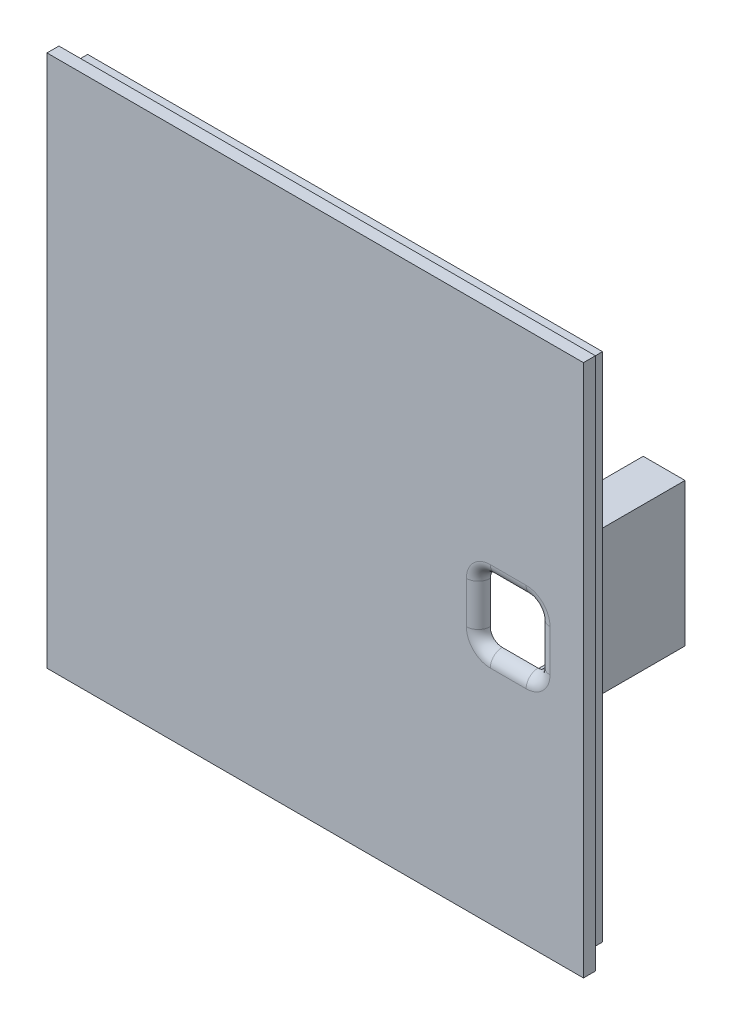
ISO-10303-21;
HEADER;
FILE_DESCRIPTION(('STEP AP214'),'2;1');
FILE_NAME('part.step','',(''),(''),'','','');
FILE_SCHEMA(('AUTOMOTIVE_DESIGN { 1 0 10303 214 1 1 1 1 }'));
ENDSEC;
DATA;
#1=APPLICATION_CONTEXT('core data for automotive mechanical design processes');
#2=APPLICATION_PROTOCOL_DEFINITION('international standard','automotive_design',2000,#1);
#3=PRODUCT_CONTEXT('',#1,'mechanical');
#4=PRODUCT('Part','Part','',(#3));
#5=PRODUCT_RELATED_PRODUCT_CATEGORY('part','',(#4));
#6=PRODUCT_DEFINITION_FORMATION('','',#4);
#7=PRODUCT_DEFINITION_CONTEXT('part definition',#1,'design');
#8=PRODUCT_DEFINITION('design','',#6,#7);
#9=PRODUCT_DEFINITION_SHAPE('','',#8);
#10=(LENGTH_UNIT() NAMED_UNIT(*) SI_UNIT(.MILLI.,.METRE.));
#11=(NAMED_UNIT(*) PLANE_ANGLE_UNIT() SI_UNIT($,.RADIAN.));
#12=(NAMED_UNIT(*) SI_UNIT($,.STERADIAN.) SOLID_ANGLE_UNIT());
#13=UNCERTAINTY_MEASURE_WITH_UNIT(LENGTH_MEASURE(1.E-05),#10,'distance_accuracy_value','');
#14=(GEOMETRIC_REPRESENTATION_CONTEXT(3) GLOBAL_UNCERTAINTY_ASSIGNED_CONTEXT((#13)) GLOBAL_UNIT_ASSIGNED_CONTEXT((#10,
#11,#12)) REPRESENTATION_CONTEXT('',''));
#15=CARTESIAN_POINT('',(0.,0.,0.));
#16=DIRECTION('',(0.,0.,1.));
#17=DIRECTION('',(1.,0.,0.));
#18=AXIS2_PLACEMENT_3D('',#15,#16,#17);
#19=CARTESIAN_POINT('',(0.,0.,0.));
#20=DIRECTION('',(0.,0.,1.));
#21=DIRECTION('',(1.,0.,0.));
#22=AXIS2_PLACEMENT_3D('',#19,#20,#21);
#23=PLANE('',#22);
#24=DIRECTION('',(0.,-1.,0.));
#25=VECTOR('',#24,1.);
#26=CARTESIAN_POINT('',(-47.6774369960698,36.0817086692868,0.));
#27=LINE('',#26,#25);
#28=CARTESIAN_POINT('',(-47.6774369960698,36.0817086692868,0.));
#29=VERTEX_POINT('',#28);
#30=CARTESIAN_POINT('',(-47.6774369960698,-45.1182913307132,0.));
#31=VERTEX_POINT('',#30);
#32=EDGE_CURVE('E605',#29,#31,#27,.T.);
#33=ORIENTED_EDGE('',*,*,#32,.F.);
#34=DIRECTION('',(-1.,0.,0.));
#35=VECTOR('',#34,1.);
#36=CARTESIAN_POINT('',(-47.6774369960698,36.0817086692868,0.));
#37=LINE('',#36,#35);
#38=CARTESIAN_POINT('',(34.1225630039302,36.0817086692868,0.));
#39=VERTEX_POINT('',#38);
#40=EDGE_CURVE('E653',#39,#29,#37,.T.);
#41=ORIENTED_EDGE('',*,*,#40,.F.);
#42=DIRECTION('',(0.,1.,0.));
#43=VECTOR('',#42,1.);
#44=CARTESIAN_POINT('',(34.1225630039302,36.0817086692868,0.));
#45=LINE('',#44,#43);
#46=CARTESIAN_POINT('',(34.1225630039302,-45.1182913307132,0.));
#47=VERTEX_POINT('',#46);
#48=EDGE_CURVE('E650',#47,#39,#45,.T.);
#49=ORIENTED_EDGE('',*,*,#48,.F.);
#50=DIRECTION('',(1.,0.,0.));
#51=VECTOR('',#50,1.);
#52=CARTESIAN_POINT('',(-47.6774369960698,-45.1182913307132,0.));
#53=LINE('',#52,#51);
#54=EDGE_CURVE('E647',#31,#47,#53,.T.);
#55=ORIENTED_EDGE('',*,*,#54,.F.);
#56=EDGE_LOOP('',(#33,#41,#49,#55));
#57=FACE_BOUND('',#56,.T.);
#58=CARTESIAN_POINT('',(28.5225630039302,-0.990921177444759,0.));
#59=DIRECTION('',(0.,0.,-1.));
#60=DIRECTION('',(1.,0.,0.));
#61=AXIS2_PLACEMENT_3D('',#58,#59,#60);
#62=CIRCLE('',#61,2.);
#63=CARTESIAN_POINT('',(28.5225630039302,1.00907882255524,0.));
#64=VERTEX_POINT('',#63);
#65=CARTESIAN_POINT('',(29.1225630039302,0.916957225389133,0.));
#66=VERTEX_POINT('',#65);
#67=EDGE_CURVE('E265',#64,#66,#62,.T.);
#68=ORIENTED_EDGE('',*,*,#67,.F.);
#69=DIRECTION('',(1.,0.,0.));
#70=VECTOR('',#69,1.);
#71=CARTESIAN_POINT('',(28.5225630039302,1.00907882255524,0.));
#72=LINE('',#71,#70);
#73=CARTESIAN_POINT('',(22.5225630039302,1.00907882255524,0.));
#74=VERTEX_POINT('',#73);
#75=EDGE_CURVE('E504',#74,#64,#72,.T.);
#76=ORIENTED_EDGE('',*,*,#75,.F.);
#77=CARTESIAN_POINT('',(22.5225630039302,-0.990921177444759,0.));
#78=DIRECTION('',(0.,0.,-1.));
#79=DIRECTION('',(1.,0.,0.));
#80=AXIS2_PLACEMENT_3D('',#77,#78,#79);
#81=CIRCLE('',#80,2.);
#82=CARTESIAN_POINT('',(20.5225630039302,-0.990921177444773,0.));
#83=VERTEX_POINT('',#82);
#84=EDGE_CURVE('E499',#83,#74,#81,.T.);
#85=ORIENTED_EDGE('',*,*,#84,.F.);
#86=DIRECTION('',(0.,1.,0.));
#87=VECTOR('',#86,1.);
#88=CARTESIAN_POINT('',(20.5225630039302,-7.99092117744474,0.));
#89=LINE('',#88,#87);
#90=CARTESIAN_POINT('',(20.5225630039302,-7.99092117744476,0.));
#91=VERTEX_POINT('',#90);
#92=EDGE_CURVE('E497',#91,#83,#89,.T.);
#93=ORIENTED_EDGE('',*,*,#92,.F.);
#94=CARTESIAN_POINT('',(22.5225630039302,-7.99092117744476,0.));
#95=DIRECTION('',(0.,0.,-1.));
#96=DIRECTION('',(-1.,0.,0.));
#97=AXIS2_PLACEMENT_3D('',#94,#95,#96);
#98=CIRCLE('',#97,2.);
#99=CARTESIAN_POINT('',(22.5225630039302,-9.99092117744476,0.));
#100=VERTEX_POINT('',#99);
#101=EDGE_CURVE('E500',#100,#91,#98,.T.);
#102=ORIENTED_EDGE('',*,*,#101,.F.);
#103=DIRECTION('',(-1.,0.,0.));
#104=VECTOR('',#103,1.);
#105=CARTESIAN_POINT('',(28.5225630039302,-9.99092117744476,0.));
#106=LINE('',#105,#104);
#107=CARTESIAN_POINT('',(28.5225630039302,-9.99092117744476,0.));
#108=VERTEX_POINT('',#107);
#109=EDGE_CURVE('E486',#108,#100,#106,.T.);
#110=ORIENTED_EDGE('',*,*,#109,.F.);
#111=CARTESIAN_POINT('',(28.5225630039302,-7.99092117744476,0.));
#112=DIRECTION('',(0.,0.,-1.));
#113=DIRECTION('',(-1.,0.,0.));
#114=AXIS2_PLACEMENT_3D('',#111,#112,#113);
#115=CIRCLE('',#114,2.);
#116=CARTESIAN_POINT('',(29.1225630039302,-9.89879958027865,0.));
#117=VERTEX_POINT('',#116);
#118=EDGE_CURVE('E264',#117,#108,#115,.T.);
#119=ORIENTED_EDGE('',*,*,#118,.F.);
#120=DIRECTION('',(0.,-1.,0.));
#121=VECTOR('',#120,1.);
#122=CARTESIAN_POINT('',(29.1225630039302,0.,0.));
#123=LINE('',#122,#121);
#124=CARTESIAN_POINT('',(29.1225630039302,-14.4909211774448,0.));
#125=VERTEX_POINT('',#124);
#126=EDGE_CURVE('E552',#117,#125,#123,.T.);
#127=ORIENTED_EDGE('',*,*,#126,.T.);
#128=DIRECTION('',(1.,0.,0.));
#129=VECTOR('',#128,1.);
#130=CARTESIAN_POINT('',(0.,-14.4909211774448,0.));
#131=LINE('',#130,#129);
#132=CARTESIAN_POINT('',(24.1225630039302,-14.4909211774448,0.));
#133=VERTEX_POINT('',#132);
#134=EDGE_CURVE('E548',#133,#125,#131,.T.);
#135=ORIENTED_EDGE('',*,*,#134,.F.);
#136=DIRECTION('',(0.,-1.,0.));
#137=VECTOR('',#136,1.);
#138=CARTESIAN_POINT('',(24.1225630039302,0.,0.));
#139=LINE('',#138,#137);
#140=CARTESIAN_POINT('',(24.1225630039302,-16.4909211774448,0.));
#141=VERTEX_POINT('',#140);
#142=EDGE_CURVE('E528',#133,#141,#139,.T.);
#143=ORIENTED_EDGE('',*,*,#142,.T.);
#144=DIRECTION('',(1.,0.,0.));
#145=VECTOR('',#144,1.);
#146=CARTESIAN_POINT('',(0.,-16.4909211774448,0.));
#147=LINE('',#146,#145);
#148=CARTESIAN_POINT('',(31.1225630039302,-16.4909211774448,0.));
#149=VERTEX_POINT('',#148);
#150=EDGE_CURVE('E536',#141,#149,#147,.T.);
#151=ORIENTED_EDGE('',*,*,#150,.T.);
#152=DIRECTION('',(0.,-1.,0.));
#153=VECTOR('',#152,1.);
#154=CARTESIAN_POINT('',(31.1225630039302,0.,0.));
#155=LINE('',#154,#153);
#156=CARTESIAN_POINT('',(31.1225630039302,7.50907882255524,0.));
#157=VERTEX_POINT('',#156);
#158=EDGE_CURVE('E567',#157,#149,#155,.T.);
#159=ORIENTED_EDGE('',*,*,#158,.F.);
#160=DIRECTION('',(1.,0.,0.));
#161=VECTOR('',#160,1.);
#162=CARTESIAN_POINT('',(0.,7.50907882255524,0.));
#163=LINE('',#162,#161);
#164=CARTESIAN_POINT('',(24.1225630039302,7.50907882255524,0.));
#165=VERTEX_POINT('',#164);
#166=EDGE_CURVE('E564',#165,#157,#163,.T.);
#167=ORIENTED_EDGE('',*,*,#166,.F.);
#168=DIRECTION('',(0.,1.,0.));
#169=VECTOR('',#168,1.);
#170=CARTESIAN_POINT('',(24.1225630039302,0.,0.));
#171=LINE('',#170,#169);
#172=CARTESIAN_POINT('',(24.1225630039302,5.50907882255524,0.));
#173=VERTEX_POINT('',#172);
#174=EDGE_CURVE('E561',#173,#165,#171,.T.);
#175=ORIENTED_EDGE('',*,*,#174,.F.);
#176=DIRECTION('',(1.,0.,0.));
#177=VECTOR('',#176,1.);
#178=CARTESIAN_POINT('',(0.,5.50907882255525,0.));
#179=LINE('',#178,#177);
#180=CARTESIAN_POINT('',(29.1225630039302,5.50907882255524,0.));
#181=VERTEX_POINT('',#180);
#182=EDGE_CURVE('E557',#173,#181,#179,.T.);
#183=ORIENTED_EDGE('',*,*,#182,.T.);
#184=EDGE_CURVE('E553',#181,#66,#123,.T.);
#185=ORIENTED_EDGE('',*,*,#184,.T.);
#186=EDGE_LOOP('',(#68,#76,#85,#93,#102,#110,#119,#127,#135,#143,#151,#159,#167,#175,#183,#185));
#187=FACE_BOUND('',#186,.T.);
#188=ADVANCED_FACE('F44',(#57,#187),#23,.F.);
#189=CARTESIAN_POINT('',(0.,0.,2.));
#190=DIRECTION('',(0.,0.,1.));
#191=DIRECTION('',(1.,0.,0.));
#192=AXIS2_PLACEMENT_3D('',#189,#190,#191);
#193=PLANE('',#192);
#194=DIRECTION('',(-1.,0.,0.));
#195=VECTOR('',#194,1.);
#196=CARTESIAN_POINT('',(22.5225630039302,-11.9909211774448,2.));
#197=LINE('',#196,#195);
#198=CARTESIAN_POINT('',(28.5225630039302,-11.9909211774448,2.));
#199=VERTEX_POINT('',#198);
#200=CARTESIAN_POINT('',(22.5225630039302,-11.9909211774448,2.));
#201=VERTEX_POINT('',#200);
#202=EDGE_CURVE('E62',#199,#201,#197,.T.);
#203=ORIENTED_EDGE('',*,*,#202,.T.);
#204=CARTESIAN_POINT('',(22.5225630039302,-7.99092117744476,2.));
#205=DIRECTION('',(0.,0.,1.));
#206=DIRECTION('',(1.,0.,0.));
#207=AXIS2_PLACEMENT_3D('',#204,#205,#206);
#208=CIRCLE('',#207,4.);
#209=CARTESIAN_POINT('',(18.5225630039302,-7.99092117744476,2.));
#210=VERTEX_POINT('',#209);
#211=EDGE_CURVE('E308',#201,#210,#208,.F.);
#212=ORIENTED_EDGE('',*,*,#211,.T.);
#213=DIRECTION('',(0.,1.,0.));
#214=VECTOR('',#213,1.);
#215=CARTESIAN_POINT('',(18.5225630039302,-0.990921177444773,2.));
#216=LINE('',#215,#214);
#217=CARTESIAN_POINT('',(18.5225630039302,-0.990921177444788,2.));
#218=VERTEX_POINT('',#217);
#219=EDGE_CURVE('E252',#210,#218,#216,.T.);
#220=ORIENTED_EDGE('',*,*,#219,.T.);
#221=CARTESIAN_POINT('',(22.5225630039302,-0.990921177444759,2.));
#222=DIRECTION('',(0.,0.,1.));
#223=DIRECTION('',(1.,0.,0.));
#224=AXIS2_PLACEMENT_3D('',#221,#222,#223);
#225=CIRCLE('',#224,4.);
#226=CARTESIAN_POINT('',(22.5225630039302,3.00907882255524,2.));
#227=VERTEX_POINT('',#226);
#228=EDGE_CURVE('E323',#218,#227,#225,.F.);
#229=ORIENTED_EDGE('',*,*,#228,.T.);
#230=DIRECTION('',(1.,0.,0.));
#231=VECTOR('',#230,1.);
#232=CARTESIAN_POINT('',(28.5225630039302,3.00907882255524,2.));
#233=LINE('',#232,#231);
#234=CARTESIAN_POINT('',(28.5225630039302,3.00907882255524,2.));
#235=VERTEX_POINT('',#234);
#236=EDGE_CURVE('E320',#227,#235,#233,.T.);
#237=ORIENTED_EDGE('',*,*,#236,.T.);
#238=CARTESIAN_POINT('',(28.5225630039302,-0.990921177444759,2.));
#239=DIRECTION('',(0.,0.,1.));
#240=DIRECTION('',(1.,0.,0.));
#241=AXIS2_PLACEMENT_3D('',#238,#239,#240);
#242=CIRCLE('',#241,4.);
#243=CARTESIAN_POINT('',(32.5225630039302,-0.990921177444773,2.));
#244=VERTEX_POINT('',#243);
#245=EDGE_CURVE('E317',#235,#244,#242,.F.);
#246=ORIENTED_EDGE('',*,*,#245,.T.);
#247=DIRECTION('',(0.,-1.,0.));
#248=VECTOR('',#247,1.);
#249=CARTESIAN_POINT('',(32.5225630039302,-7.99092117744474,2.));
#250=LINE('',#249,#248);
#251=CARTESIAN_POINT('',(32.5225630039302,-7.99092117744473,2.));
#252=VERTEX_POINT('',#251);
#253=EDGE_CURVE('E274',#244,#252,#250,.T.);
#254=ORIENTED_EDGE('',*,*,#253,.T.);
#255=CARTESIAN_POINT('',(28.5225630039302,-7.99092117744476,2.));
#256=DIRECTION('',(0.,0.,1.));
#257=DIRECTION('',(1.,0.,0.));
#258=AXIS2_PLACEMENT_3D('',#255,#256,#257);
#259=CIRCLE('',#258,4.);
#260=EDGE_CURVE('E67',#252,#199,#259,.F.);
#261=ORIENTED_EDGE('',*,*,#260,.T.);
#262=EDGE_LOOP('',(#203,#212,#220,#229,#237,#246,#254,#261));
#263=FACE_BOUND('',#262,.T.);
#264=DIRECTION('',(0.,-1.,0.));
#265=VECTOR('',#264,1.);
#266=CARTESIAN_POINT('',(-51.6774369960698,40.0817086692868,2.));
#267=LINE('',#266,#265);
#268=CARTESIAN_POINT('',(-51.6774369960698,40.0817086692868,2.));
#269=VERTEX_POINT('',#268);
#270=CARTESIAN_POINT('',(-51.6774369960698,-49.1182913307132,2.));
#271=VERTEX_POINT('',#270);
#272=EDGE_CURVE('E457',#269,#271,#267,.T.);
#273=ORIENTED_EDGE('',*,*,#272,.T.);
#274=DIRECTION('',(1.,0.,0.));
#275=VECTOR('',#274,1.);
#276=CARTESIAN_POINT('',(-51.6774369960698,-49.1182913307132,2.));
#277=LINE('',#276,#275);
#278=CARTESIAN_POINT('',(38.1225630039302,-49.1182913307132,2.));
#279=VERTEX_POINT('',#278);
#280=EDGE_CURVE('E691',#271,#279,#277,.T.);
#281=ORIENTED_EDGE('',*,*,#280,.T.);
#282=DIRECTION('',(0.,1.,0.));
#283=VECTOR('',#282,1.);
#284=CARTESIAN_POINT('',(38.1225630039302,-49.1182913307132,2.));
#285=LINE('',#284,#283);
#286=CARTESIAN_POINT('',(38.1225630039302,40.0817086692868,2.));
#287=VERTEX_POINT('',#286);
#288=EDGE_CURVE('E448',#279,#287,#285,.T.);
#289=ORIENTED_EDGE('',*,*,#288,.T.);
#290=DIRECTION('',(-1.,0.,0.));
#291=VECTOR('',#290,1.);
#292=CARTESIAN_POINT('',(38.1225630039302,40.0817086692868,2.));
#293=LINE('',#292,#291);
#294=EDGE_CURVE('E465',#287,#269,#293,.T.);
#295=ORIENTED_EDGE('',*,*,#294,.T.);
#296=EDGE_LOOP('',(#273,#281,#289,#295));
#297=FACE_BOUND('',#296,.T.);
#298=ADVANCED_FACE('F377',(#263,#297),#193,.T.);
#299=CARTESIAN_POINT('',(0.,0.,0.));
#300=DIRECTION('',(0.,0.,1.));
#301=DIRECTION('',(1.,0.,0.));
#302=AXIS2_PLACEMENT_3D('',#299,#300,#301);
#303=PLANE('',#302);
#304=DIRECTION('',(-1.,0.,0.));
#305=VECTOR('',#304,1.);
#306=CARTESIAN_POINT('',(36.3125630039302,-47.3082913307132,0.));
#307=LINE('',#306,#305);
#308=CARTESIAN_POINT('',(36.3125630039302,-47.3082913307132,0.));
#309=VERTEX_POINT('',#308);
#310=CARTESIAN_POINT('',(-49.8674369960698,-47.3082913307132,0.));
#311=VERTEX_POINT('',#310);
#312=EDGE_CURVE('E619',#309,#311,#307,.T.);
#313=ORIENTED_EDGE('',*,*,#312,.F.);
#314=DIRECTION('',(0.,-1.,0.));
#315=VECTOR('',#314,1.);
#316=CARTESIAN_POINT('',(36.3125630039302,38.2717086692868,0.));
#317=LINE('',#316,#315);
#318=CARTESIAN_POINT('',(36.3125630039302,38.2717086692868,0.));
#319=VERTEX_POINT('',#318);
#320=EDGE_CURVE('E600',#319,#309,#317,.T.);
#321=ORIENTED_EDGE('',*,*,#320,.F.);
#322=DIRECTION('',(1.,0.,0.));
#323=VECTOR('',#322,1.);
#324=CARTESIAN_POINT('',(-49.8674369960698,38.2717086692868,0.));
#325=LINE('',#324,#323);
#326=CARTESIAN_POINT('',(-49.8674369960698,38.2717086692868,0.));
#327=VERTEX_POINT('',#326);
#328=EDGE_CURVE('E628',#327,#319,#325,.T.);
#329=ORIENTED_EDGE('',*,*,#328,.F.);
#330=DIRECTION('',(0.,1.,0.));
#331=VECTOR('',#330,1.);
#332=CARTESIAN_POINT('',(-49.8674369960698,-47.3082913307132,0.));
#333=LINE('',#332,#331);
#334=EDGE_CURVE('E633',#311,#327,#333,.T.);
#335=ORIENTED_EDGE('',*,*,#334,.F.);
#336=EDGE_LOOP('',(#313,#321,#329,#335));
#337=FACE_BOUND('',#336,.T.);
#338=DIRECTION('',(0.,-1.,0.));
#339=VECTOR('',#338,1.);
#340=CARTESIAN_POINT('',(-51.6774369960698,40.0817086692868,0.));
#341=LINE('',#340,#339);
#342=CARTESIAN_POINT('',(-51.6774369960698,40.0817086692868,0.));
#343=VERTEX_POINT('',#342);
#344=CARTESIAN_POINT('',(-51.6774369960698,-49.1182913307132,0.));
#345=VERTEX_POINT('',#344);
#346=EDGE_CURVE('E444',#343,#345,#341,.T.);
#347=ORIENTED_EDGE('',*,*,#346,.F.);
#348=DIRECTION('',(-1.,0.,0.));
#349=VECTOR('',#348,1.);
#350=CARTESIAN_POINT('',(38.1225630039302,40.0817086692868,0.));
#351=LINE('',#350,#349);
#352=CARTESIAN_POINT('',(38.1225630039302,40.0817086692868,0.));
#353=VERTEX_POINT('',#352);
#354=EDGE_CURVE('E453',#353,#343,#351,.T.);
#355=ORIENTED_EDGE('',*,*,#354,.F.);
#356=DIRECTION('',(0.,1.,0.));
#357=VECTOR('',#356,1.);
#358=CARTESIAN_POINT('',(38.1225630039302,-49.1182913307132,0.));
#359=LINE('',#358,#357);
#360=CARTESIAN_POINT('',(38.1225630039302,-49.1182913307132,0.));
#361=VERTEX_POINT('',#360);
#362=EDGE_CURVE('E443',#361,#353,#359,.T.);
#363=ORIENTED_EDGE('',*,*,#362,.F.);
#364=DIRECTION('',(1.,0.,0.));
#365=VECTOR('',#364,1.);
#366=CARTESIAN_POINT('',(-51.6774369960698,-49.1182913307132,0.));
#367=LINE('',#366,#365);
#368=EDGE_CURVE('E432',#345,#361,#367,.T.);
#369=ORIENTED_EDGE('',*,*,#368,.F.);
#370=EDGE_LOOP('',(#347,#355,#363,#369));
#371=FACE_BOUND('',#370,.T.);
#372=ADVANCED_FACE('F383',(#337,#371),#303,.F.);
#373=CARTESIAN_POINT('',(-51.6774369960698,40.0817086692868,2.));
#374=DIRECTION('',(1.,0.,0.));
#375=DIRECTION('',(0.,1.,0.));
#376=AXIS2_PLACEMENT_3D('',#373,#374,#375);
#377=PLANE('',#376);
#378=ORIENTED_EDGE('',*,*,#346,.T.);
#379=DIRECTION('',(0.,0.,-1.));
#380=VECTOR('',#379,1.);
#381=CARTESIAN_POINT('',(-51.6774369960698,-49.1182913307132,2.));
#382=LINE('',#381,#380);
#383=EDGE_CURVE('E437',#271,#345,#382,.T.);
#384=ORIENTED_EDGE('',*,*,#383,.F.);
#385=ORIENTED_EDGE('',*,*,#272,.F.);
#386=DIRECTION('',(0.,0.,-1.));
#387=VECTOR('',#386,1.);
#388=CARTESIAN_POINT('',(-51.6774369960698,40.0817086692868,2.));
#389=LINE('',#388,#387);
#390=EDGE_CURVE('E461',#269,#343,#389,.T.);
#391=ORIENTED_EDGE('',*,*,#390,.T.);
#392=EDGE_LOOP('',(#378,#384,#385,#391));
#393=FACE_BOUND('',#392,.T.);
#394=ADVANCED_FACE('F347',(#393),#377,.F.);
#395=CARTESIAN_POINT('',(-51.6774369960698,-49.1182913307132,2.));
#396=DIRECTION('',(0.,1.,0.));
#397=DIRECTION('',(0.,0.,1.));
#398=AXIS2_PLACEMENT_3D('',#395,#396,#397);
#399=PLANE('',#398);
#400=ORIENTED_EDGE('',*,*,#368,.T.);
#401=DIRECTION('',(0.,0.,-1.));
#402=VECTOR('',#401,1.);
#403=CARTESIAN_POINT('',(38.1225630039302,-49.1182913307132,2.));
#404=LINE('',#403,#402);
#405=EDGE_CURVE('E434',#279,#361,#404,.T.);
#406=ORIENTED_EDGE('',*,*,#405,.F.);
#407=ORIENTED_EDGE('',*,*,#280,.F.);
#408=ORIENTED_EDGE('',*,*,#383,.T.);
#409=EDGE_LOOP('',(#400,#406,#407,#408));
#410=FACE_BOUND('',#409,.T.);
#411=ADVANCED_FACE('F422',(#410),#399,.F.);
#412=CARTESIAN_POINT('',(38.1225630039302,-49.1182913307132,2.));
#413=DIRECTION('',(-1.,0.,0.));
#414=DIRECTION('',(0.,-1.,0.));
#415=AXIS2_PLACEMENT_3D('',#412,#413,#414);
#416=PLANE('',#415);
#417=ORIENTED_EDGE('',*,*,#362,.T.);
#418=DIRECTION('',(0.,0.,-1.));
#419=VECTOR('',#418,1.);
#420=CARTESIAN_POINT('',(38.1225630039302,40.0817086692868,2.));
#421=LINE('',#420,#419);
#422=EDGE_CURVE('E450',#287,#353,#421,.T.);
#423=ORIENTED_EDGE('',*,*,#422,.F.);
#424=ORIENTED_EDGE('',*,*,#288,.F.);
#425=ORIENTED_EDGE('',*,*,#405,.T.);
#426=EDGE_LOOP('',(#417,#423,#424,#425));
#427=FACE_BOUND('',#426,.T.);
#428=ADVANCED_FACE('F419',(#427),#416,.F.);
#429=CARTESIAN_POINT('',(38.1225630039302,40.0817086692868,2.));
#430=DIRECTION('',(0.,-1.,0.));
#431=DIRECTION('',(1.,0.,0.));
#432=AXIS2_PLACEMENT_3D('',#429,#430,#431);
#433=PLANE('',#432);
#434=ORIENTED_EDGE('',*,*,#354,.T.);
#435=ORIENTED_EDGE('',*,*,#390,.F.);
#436=ORIENTED_EDGE('',*,*,#294,.F.);
#437=ORIENTED_EDGE('',*,*,#422,.T.);
#438=EDGE_LOOP('',(#434,#435,#436,#437));
#439=FACE_BOUND('',#438,.T.);
#440=ADVANCED_FACE('F416',(#439),#433,.F.);
#441=CARTESIAN_POINT('',(36.3125630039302,38.2717086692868,121.453401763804));
#442=DIRECTION('',(1.,0.,0.));
#443=DIRECTION('',(0.,0.,-1.));
#444=AXIS2_PLACEMENT_3D('',#441,#442,#443);
#445=PLANE('',#444);
#446=DIRECTION('',(0.,0.,-1.));
#447=VECTOR('',#446,1.);
#448=CARTESIAN_POINT('',(36.3125630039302,38.2717086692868,121.453401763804));
#449=LINE('',#448,#447);
#450=CARTESIAN_POINT('',(36.3125630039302,38.2717086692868,-3.));
#451=VERTEX_POINT('',#450);
#452=EDGE_CURVE('E632',#319,#451,#449,.T.);
#453=ORIENTED_EDGE('',*,*,#452,.F.);
#454=ORIENTED_EDGE('',*,*,#320,.T.);
#455=DIRECTION('',(0.,0.,-1.));
#456=VECTOR('',#455,1.);
#457=CARTESIAN_POINT('',(36.3125630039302,-47.3082913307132,121.453401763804));
#458=LINE('',#457,#456);
#459=CARTESIAN_POINT('',(36.3125630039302,-47.3082913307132,-3.));
#460=VERTEX_POINT('',#459);
#461=EDGE_CURVE('E627',#309,#460,#458,.T.);
#462=ORIENTED_EDGE('',*,*,#461,.T.);
#463=DIRECTION('',(0.,-1.,0.));
#464=VECTOR('',#463,1.);
#465=CARTESIAN_POINT('',(36.3125630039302,38.2717086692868,-3.));
#466=LINE('',#465,#464);
#467=EDGE_CURVE('E614',#451,#460,#466,.T.);
#468=ORIENTED_EDGE('',*,*,#467,.F.);
#469=EDGE_LOOP('',(#453,#454,#462,#468));
#470=FACE_BOUND('',#469,.T.);
#471=ADVANCED_FACE('F389',(#470),#445,.T.);
#472=CARTESIAN_POINT('',(-49.8674369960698,38.2717086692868,121.453401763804));
#473=DIRECTION('',(0.,1.,0.));
#474=DIRECTION('',(0.,0.,1.));
#475=AXIS2_PLACEMENT_3D('',#472,#473,#474);
#476=PLANE('',#475);
#477=DIRECTION('',(0.,0.,-1.));
#478=VECTOR('',#477,1.);
#479=CARTESIAN_POINT('',(-49.8674369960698,38.2717086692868,121.453401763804));
#480=LINE('',#479,#478);
#481=CARTESIAN_POINT('',(-49.8674369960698,38.2717086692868,-3.));
#482=VERTEX_POINT('',#481);
#483=EDGE_CURVE('E623',#327,#482,#480,.T.);
#484=ORIENTED_EDGE('',*,*,#483,.F.);
#485=ORIENTED_EDGE('',*,*,#328,.T.);
#486=ORIENTED_EDGE('',*,*,#452,.T.);
#487=DIRECTION('',(1.,0.,0.));
#488=VECTOR('',#487,1.);
#489=CARTESIAN_POINT('',(-49.8674369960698,38.2717086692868,-3.));
#490=LINE('',#489,#488);
#491=EDGE_CURVE('E601',#482,#451,#490,.T.);
#492=ORIENTED_EDGE('',*,*,#491,.F.);
#493=EDGE_LOOP('',(#484,#485,#486,#492));
#494=FACE_BOUND('',#493,.T.);
#495=ADVANCED_FACE('F761',(#494),#476,.T.);
#496=CARTESIAN_POINT('',(-49.8674369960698,-47.3082913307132,121.453401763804));
#497=DIRECTION('',(-1.,0.,0.));
#498=DIRECTION('',(0.,0.,1.));
#499=AXIS2_PLACEMENT_3D('',#496,#497,#498);
#500=PLANE('',#499);
#501=DIRECTION('',(0.,0.,-1.));
#502=VECTOR('',#501,1.);
#503=CARTESIAN_POINT('',(-49.8674369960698,-47.3082913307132,121.453401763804));
#504=LINE('',#503,#502);
#505=CARTESIAN_POINT('',(-49.8674369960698,-47.3082913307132,-3.));
#506=VERTEX_POINT('',#505);
#507=EDGE_CURVE('E618',#311,#506,#504,.T.);
#508=ORIENTED_EDGE('',*,*,#507,.F.);
#509=ORIENTED_EDGE('',*,*,#334,.T.);
#510=ORIENTED_EDGE('',*,*,#483,.T.);
#511=DIRECTION('',(0.,1.,0.));
#512=VECTOR('',#511,1.);
#513=CARTESIAN_POINT('',(-49.8674369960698,-47.3082913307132,-3.));
#514=LINE('',#513,#512);
#515=EDGE_CURVE('E606',#506,#482,#514,.T.);
#516=ORIENTED_EDGE('',*,*,#515,.F.);
#517=EDGE_LOOP('',(#508,#509,#510,#516));
#518=FACE_BOUND('',#517,.T.);
#519=ADVANCED_FACE('F758',(#518),#500,.T.);
#520=CARTESIAN_POINT('',(36.3125630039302,-47.3082913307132,121.453401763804));
#521=DIRECTION('',(0.,-1.,0.));
#522=DIRECTION('',(0.,0.,-1.));
#523=AXIS2_PLACEMENT_3D('',#520,#521,#522);
#524=PLANE('',#523);
#525=ORIENTED_EDGE('',*,*,#461,.F.);
#526=ORIENTED_EDGE('',*,*,#312,.T.);
#527=ORIENTED_EDGE('',*,*,#507,.T.);
#528=DIRECTION('',(-1.,0.,0.));
#529=VECTOR('',#528,1.);
#530=CARTESIAN_POINT('',(36.3125630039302,-47.3082913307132,-3.));
#531=LINE('',#530,#529);
#532=EDGE_CURVE('E610',#460,#506,#531,.T.);
#533=ORIENTED_EDGE('',*,*,#532,.F.);
#534=EDGE_LOOP('',(#525,#526,#527,#533));
#535=FACE_BOUND('',#534,.T.);
#536=ADVANCED_FACE('F401',(#535),#524,.T.);
#537=CARTESIAN_POINT('',(-47.6774369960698,-45.1182913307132,-3.));
#538=DIRECTION('',(0.,-1.,0.));
#539=DIRECTION('',(0.,0.,-1.));
#540=AXIS2_PLACEMENT_3D('',#537,#538,#539);
#541=PLANE('',#540);
#542=ORIENTED_EDGE('',*,*,#54,.T.);
#543=DIRECTION('',(0.,0.,1.));
#544=VECTOR('',#543,1.);
#545=CARTESIAN_POINT('',(34.1225630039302,-45.1182913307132,-3.));
#546=LINE('',#545,#544);
#547=CARTESIAN_POINT('',(34.1225630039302,-45.1182913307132,-3.));
#548=VERTEX_POINT('',#547);
#549=EDGE_CURVE('E678',#548,#47,#546,.T.);
#550=ORIENTED_EDGE('',*,*,#549,.F.);
#551=DIRECTION('',(1.,0.,0.));
#552=VECTOR('',#551,1.);
#553=CARTESIAN_POINT('',(-47.6774369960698,-45.1182913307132,-3.));
#554=LINE('',#553,#552);
#555=CARTESIAN_POINT('',(-47.6774369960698,-45.1182913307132,-3.));
#556=VERTEX_POINT('',#555);
#557=EDGE_CURVE('E665',#556,#548,#554,.T.);
#558=ORIENTED_EDGE('',*,*,#557,.F.);
#559=DIRECTION('',(0.,0.,1.));
#560=VECTOR('',#559,1.);
#561=CARTESIAN_POINT('',(-47.6774369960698,-45.1182913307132,-3.));
#562=LINE('',#561,#560);
#563=EDGE_CURVE('E682',#556,#31,#562,.T.);
#564=ORIENTED_EDGE('',*,*,#563,.T.);
#565=EDGE_LOOP('',(#542,#550,#558,#564));
#566=FACE_BOUND('',#565,.T.);
#567=ADVANCED_FACE('F397',(#566),#541,.F.);
#568=CARTESIAN_POINT('',(-47.6774369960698,36.0817086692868,-3.));
#569=DIRECTION('',(-1.,0.,0.));
#570=DIRECTION('',(0.,-1.,0.));
#571=AXIS2_PLACEMENT_3D('',#568,#569,#570);
#572=PLANE('',#571);
#573=ORIENTED_EDGE('',*,*,#32,.T.);
#574=ORIENTED_EDGE('',*,*,#563,.F.);
#575=DIRECTION('',(0.,-1.,0.));
#576=VECTOR('',#575,1.);
#577=CARTESIAN_POINT('',(-47.6774369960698,36.0817086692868,-3.));
#578=LINE('',#577,#576);
#579=CARTESIAN_POINT('',(-47.6774369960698,36.0817086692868,-3.));
#580=VERTEX_POINT('',#579);
#581=EDGE_CURVE('E661',#580,#556,#578,.T.);
#582=ORIENTED_EDGE('',*,*,#581,.F.);
#583=DIRECTION('',(0.,0.,1.));
#584=VECTOR('',#583,1.);
#585=CARTESIAN_POINT('',(-47.6774369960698,36.0817086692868,-3.));
#586=LINE('',#585,#584);
#587=EDGE_CURVE('E673',#580,#29,#586,.T.);
#588=ORIENTED_EDGE('',*,*,#587,.T.);
#589=EDGE_LOOP('',(#573,#574,#582,#588));
#590=FACE_BOUND('',#589,.T.);
#591=ADVANCED_FACE('F400',(#590),#572,.F.);
#592=CARTESIAN_POINT('',(-47.6774369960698,36.0817086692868,-3.));
#593=DIRECTION('',(0.,1.,0.));
#594=DIRECTION('',(0.,0.,1.));
#595=AXIS2_PLACEMENT_3D('',#592,#593,#594);
#596=PLANE('',#595);
#597=ORIENTED_EDGE('',*,*,#40,.T.);
#598=ORIENTED_EDGE('',*,*,#587,.F.);
#599=DIRECTION('',(-1.,0.,0.));
#600=VECTOR('',#599,1.);
#601=CARTESIAN_POINT('',(-47.6774369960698,36.0817086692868,-3.));
#602=LINE('',#601,#600);
#603=CARTESIAN_POINT('',(34.1225630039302,36.0817086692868,-3.));
#604=VERTEX_POINT('',#603);
#605=EDGE_CURVE('E657',#604,#580,#602,.T.);
#606=ORIENTED_EDGE('',*,*,#605,.F.);
#607=DIRECTION('',(0.,0.,1.));
#608=VECTOR('',#607,1.);
#609=CARTESIAN_POINT('',(34.1225630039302,36.0817086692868,-3.));
#610=LINE('',#609,#608);
#611=EDGE_CURVE('E674',#604,#39,#610,.T.);
#612=ORIENTED_EDGE('',*,*,#611,.T.);
#613=EDGE_LOOP('',(#597,#598,#606,#612));
#614=FACE_BOUND('',#613,.T.);
#615=ADVANCED_FACE('F395',(#614),#596,.F.);
#616=CARTESIAN_POINT('',(34.1225630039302,36.0817086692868,-3.));
#617=DIRECTION('',(1.,0.,0.));
#618=DIRECTION('',(0.,0.,-1.));
#619=AXIS2_PLACEMENT_3D('',#616,#617,#618);
#620=PLANE('',#619);
#621=ORIENTED_EDGE('',*,*,#48,.T.);
#622=ORIENTED_EDGE('',*,*,#611,.F.);
#623=DIRECTION('',(0.,1.,0.));
#624=VECTOR('',#623,1.);
#625=CARTESIAN_POINT('',(34.1225630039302,36.0817086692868,-3.));
#626=LINE('',#625,#624);
#627=EDGE_CURVE('E669',#548,#604,#626,.T.);
#628=ORIENTED_EDGE('',*,*,#627,.F.);
#629=ORIENTED_EDGE('',*,*,#549,.T.);
#630=EDGE_LOOP('',(#621,#622,#628,#629));
#631=FACE_BOUND('',#630,.T.);
#632=ADVANCED_FACE('F391',(#631),#620,.F.);
#633=CARTESIAN_POINT('',(0.,0.,-3.));
#634=DIRECTION('',(0.,0.,1.));
#635=DIRECTION('',(1.,0.,0.));
#636=AXIS2_PLACEMENT_3D('',#633,#634,#635);
#637=PLANE('',#636);
#638=ORIENTED_EDGE('',*,*,#627,.T.);
#639=ORIENTED_EDGE('',*,*,#605,.T.);
#640=ORIENTED_EDGE('',*,*,#581,.T.);
#641=ORIENTED_EDGE('',*,*,#557,.T.);
#642=EDGE_LOOP('',(#638,#639,#640,#641));
#643=FACE_BOUND('',#642,.T.);
#644=ORIENTED_EDGE('',*,*,#467,.T.);
#645=ORIENTED_EDGE('',*,*,#532,.T.);
#646=ORIENTED_EDGE('',*,*,#515,.T.);
#647=ORIENTED_EDGE('',*,*,#491,.T.);
#648=EDGE_LOOP('',(#644,#645,#646,#647));
#649=FACE_BOUND('',#648,.T.);
#650=ADVANCED_FACE('F394',(#643,#649),#637,.F.);
#651=CARTESIAN_POINT('',(24.1225630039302,0.,-20.));
#652=DIRECTION('',(-1.,0.,0.));
#653=DIRECTION('',(0.,0.,1.));
#654=AXIS2_PLACEMENT_3D('',#651,#652,#653);
#655=PLANE('',#654);
#656=ORIENTED_EDGE('',*,*,#142,.F.);
#657=DIRECTION('',(0.,0.,1.));
#658=VECTOR('',#657,1.);
#659=CARTESIAN_POINT('',(24.1225630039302,-14.4909211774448,-20.));
#660=LINE('',#659,#658);
#661=CARTESIAN_POINT('',(24.1225630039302,-14.4909211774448,-20.));
#662=VERTEX_POINT('',#661);
#663=EDGE_CURVE('E597',#662,#133,#660,.T.);
#664=ORIENTED_EDGE('',*,*,#663,.F.);
#665=DIRECTION('',(0.,1.,0.));
#666=VECTOR('',#665,1.);
#667=CARTESIAN_POINT('',(24.1225630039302,7.50907882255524,-20.));
#668=LINE('',#667,#666);
#669=CARTESIAN_POINT('',(24.1225630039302,5.50907882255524,-20.));
#670=VERTEX_POINT('',#669);
#671=EDGE_CURVE('E511',#662,#670,#668,.T.);
#672=ORIENTED_EDGE('',*,*,#671,.T.);
#673=DIRECTION('',(0.,0.,1.));
#674=VECTOR('',#673,1.);
#675=CARTESIAN_POINT('',(24.1225630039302,5.50907882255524,-20.));
#676=LINE('',#675,#674);
#677=EDGE_CURVE('E587',#670,#173,#676,.T.);
#678=ORIENTED_EDGE('',*,*,#677,.T.);
#679=ORIENTED_EDGE('',*,*,#174,.T.);
#680=DIRECTION('',(0.,0.,1.));
#681=VECTOR('',#680,1.);
#682=CARTESIAN_POINT('',(24.1225630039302,7.50907882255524,-20.));
#683=LINE('',#682,#681);
#684=CARTESIAN_POINT('',(24.1225630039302,7.50907882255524,-22.));
#685=VERTEX_POINT('',#684);
#686=EDGE_CURVE('E583',#685,#165,#683,.T.);
#687=ORIENTED_EDGE('',*,*,#686,.F.);
#688=DIRECTION('',(0.,1.,0.));
#689=VECTOR('',#688,1.);
#690=CARTESIAN_POINT('',(24.1225630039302,7.50907882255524,-22.));
#691=LINE('',#690,#689);
#692=CARTESIAN_POINT('',(24.1225630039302,-16.4909211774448,-22.));
#693=VERTEX_POINT('',#692);
#694=EDGE_CURVE('E512',#693,#685,#691,.T.);
#695=ORIENTED_EDGE('',*,*,#694,.F.);
#696=DIRECTION('',(0.,0.,1.));
#697=VECTOR('',#696,1.);
#698=CARTESIAN_POINT('',(24.1225630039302,-16.4909211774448,-20.));
#699=LINE('',#698,#697);
#700=EDGE_CURVE('E544',#693,#141,#699,.T.);
#701=ORIENTED_EDGE('',*,*,#700,.T.);
#702=EDGE_LOOP('',(#656,#664,#672,#678,#679,#687,#695,#701));
#703=FACE_BOUND('',#702,.T.);
#704=ADVANCED_FACE('F410',(#703),#655,.T.);
#705=CARTESIAN_POINT('',(0.,-14.4909211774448,-20.));
#706=DIRECTION('',(0.,-1.,0.));
#707=DIRECTION('',(1.,0.,0.));
#708=AXIS2_PLACEMENT_3D('',#705,#706,#707);
#709=PLANE('',#708);
#710=ORIENTED_EDGE('',*,*,#134,.T.);
#711=DIRECTION('',(0.,0.,1.));
#712=VECTOR('',#711,1.);
#713=CARTESIAN_POINT('',(29.1225630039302,-14.4909211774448,-20.));
#714=LINE('',#713,#712);
#715=CARTESIAN_POINT('',(29.1225630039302,-14.4909211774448,-20.));
#716=VERTEX_POINT('',#715);
#717=EDGE_CURVE('E593',#716,#125,#714,.T.);
#718=ORIENTED_EDGE('',*,*,#717,.F.);
#719=DIRECTION('',(1.,0.,0.));
#720=VECTOR('',#719,1.);
#721=CARTESIAN_POINT('',(0.,-14.4909211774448,-20.));
#722=LINE('',#721,#720);
#723=EDGE_CURVE('E532',#662,#716,#722,.T.);
#724=ORIENTED_EDGE('',*,*,#723,.F.);
#725=ORIENTED_EDGE('',*,*,#663,.T.);
#726=EDGE_LOOP('',(#710,#718,#724,#725));
#727=FACE_BOUND('',#726,.T.);
#728=ADVANCED_FACE('F708',(#727),#709,.F.);
#729=CARTESIAN_POINT('',(29.1225630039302,0.,-20.));
#730=DIRECTION('',(-1.,0.,0.));
#731=DIRECTION('',(0.,0.,1.));
#732=AXIS2_PLACEMENT_3D('',#729,#730,#731);
#733=PLANE('',#732);
#734=ORIENTED_EDGE('',*,*,#126,.F.);
#735=DIRECTION('',(0.,0.,-1.));
#736=VECTOR('',#735,1.);
#737=CARTESIAN_POINT('',(29.1225630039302,-9.89879958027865,0.));
#738=LINE('',#737,#736);
#739=CARTESIAN_POINT('',(29.1225630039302,-9.89879958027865,-1.90787840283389));
#740=VERTEX_POINT('',#739);
#741=EDGE_CURVE('E474',#117,#740,#738,.T.);
#742=ORIENTED_EDGE('',*,*,#741,.T.);
#743=DIRECTION('',(0.,-1.,0.));
#744=VECTOR('',#743,1.);
#745=CARTESIAN_POINT('',(29.1225630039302,0.916957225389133,-1.90787840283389));
#746=LINE('',#745,#744);
#747=CARTESIAN_POINT('',(29.1225630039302,0.916957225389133,-1.90787840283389));
#748=VERTEX_POINT('',#747);
#749=EDGE_CURVE('E472',#740,#748,#746,.F.);
#750=ORIENTED_EDGE('',*,*,#749,.T.);
#751=DIRECTION('',(0.,0.,-1.));
#752=VECTOR('',#751,1.);
#753=CARTESIAN_POINT('',(29.1225630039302,0.916957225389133,-1.90787840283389));
#754=LINE('',#753,#752);
#755=EDGE_CURVE('E247',#748,#66,#754,.F.);
#756=ORIENTED_EDGE('',*,*,#755,.T.);
#757=ORIENTED_EDGE('',*,*,#184,.F.);
#758=DIRECTION('',(0.,0.,1.));
#759=VECTOR('',#758,1.);
#760=CARTESIAN_POINT('',(29.1225630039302,5.50907882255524,-20.));
#761=LINE('',#760,#759);
#762=CARTESIAN_POINT('',(29.1225630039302,5.50907882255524,-20.));
#763=VERTEX_POINT('',#762);
#764=EDGE_CURVE('E590',#763,#181,#761,.T.);
#765=ORIENTED_EDGE('',*,*,#764,.F.);
#766=DIRECTION('',(0.,-1.,0.));
#767=VECTOR('',#766,1.);
#768=CARTESIAN_POINT('',(29.1225630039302,0.,-20.));
#769=LINE('',#768,#767);
#770=EDGE_CURVE('E535',#763,#716,#769,.T.);
#771=ORIENTED_EDGE('',*,*,#770,.T.);
#772=ORIENTED_EDGE('',*,*,#717,.T.);
#773=EDGE_LOOP('',(#734,#742,#750,#756,#757,#765,#771,#772));
#774=FACE_BOUND('',#773,.T.);
#775=ADVANCED_FACE('F704',(#774),#733,.T.);
#776=CARTESIAN_POINT('',(0.,5.50907882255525,-20.));
#777=DIRECTION('',(0.,-1.,0.));
#778=DIRECTION('',(1.,0.,0.));
#779=AXIS2_PLACEMENT_3D('',#776,#777,#778);
#780=PLANE('',#779);
#781=ORIENTED_EDGE('',*,*,#182,.F.);
#782=ORIENTED_EDGE('',*,*,#677,.F.);
#783=DIRECTION('',(1.,0.,0.));
#784=VECTOR('',#783,1.);
#785=CARTESIAN_POINT('',(0.,5.50907882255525,-20.));
#786=LINE('',#785,#784);
#787=EDGE_CURVE('E540',#670,#763,#786,.T.);
#788=ORIENTED_EDGE('',*,*,#787,.T.);
#789=ORIENTED_EDGE('',*,*,#764,.T.);
#790=EDGE_LOOP('',(#781,#782,#788,#789));
#791=FACE_BOUND('',#790,.T.);
#792=ADVANCED_FACE('F731',(#791),#780,.T.);
#793=CARTESIAN_POINT('',(0.,7.50907882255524,-20.));
#794=DIRECTION('',(0.,-1.,0.));
#795=DIRECTION('',(0.,0.,-1.));
#796=AXIS2_PLACEMENT_3D('',#793,#794,#795);
#797=PLANE('',#796);
#798=ORIENTED_EDGE('',*,*,#166,.T.);
#799=DIRECTION('',(0.,0.,1.));
#800=VECTOR('',#799,1.);
#801=CARTESIAN_POINT('',(31.1225630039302,7.50907882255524,-20.));
#802=LINE('',#801,#800);
#803=CARTESIAN_POINT('',(31.1225630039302,7.50907882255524,-22.));
#804=VERTEX_POINT('',#803);
#805=EDGE_CURVE('E579',#804,#157,#802,.T.);
#806=ORIENTED_EDGE('',*,*,#805,.F.);
#807=DIRECTION('',(1.,0.,0.));
#808=VECTOR('',#807,1.);
#809=CARTESIAN_POINT('',(24.1225630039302,7.50907882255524,-22.));
#810=LINE('',#809,#808);
#811=EDGE_CURVE('E516',#685,#804,#810,.T.);
#812=ORIENTED_EDGE('',*,*,#811,.F.);
#813=ORIENTED_EDGE('',*,*,#686,.T.);
#814=EDGE_LOOP('',(#798,#806,#812,#813));
#815=FACE_BOUND('',#814,.T.);
#816=ADVANCED_FACE('F726',(#815),#797,.F.);
#817=CARTESIAN_POINT('',(31.1225630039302,0.,-20.));
#818=DIRECTION('',(-1.,0.,0.));
#819=DIRECTION('',(0.,0.,1.));
#820=AXIS2_PLACEMENT_3D('',#817,#818,#819);
#821=PLANE('',#820);
#822=ORIENTED_EDGE('',*,*,#158,.T.);
#823=DIRECTION('',(0.,0.,1.));
#824=VECTOR('',#823,1.);
#825=CARTESIAN_POINT('',(31.1225630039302,-16.4909211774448,-20.));
#826=LINE('',#825,#824);
#827=CARTESIAN_POINT('',(31.1225630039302,-16.4909211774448,-22.));
#828=VERTEX_POINT('',#827);
#829=EDGE_CURVE('E575',#828,#149,#826,.T.);
#830=ORIENTED_EDGE('',*,*,#829,.F.);
#831=DIRECTION('',(0.,-1.,0.));
#832=VECTOR('',#831,1.);
#833=CARTESIAN_POINT('',(31.1225630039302,7.50907882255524,-22.));
#834=LINE('',#833,#832);
#835=EDGE_CURVE('E520',#804,#828,#834,.T.);
#836=ORIENTED_EDGE('',*,*,#835,.F.);
#837=ORIENTED_EDGE('',*,*,#805,.T.);
#838=EDGE_LOOP('',(#822,#830,#836,#837));
#839=FACE_BOUND('',#838,.T.);
#840=ADVANCED_FACE('F721',(#839),#821,.F.);
#841=CARTESIAN_POINT('',(0.,-16.4909211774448,-20.));
#842=DIRECTION('',(0.,-1.,0.));
#843=DIRECTION('',(0.,0.,-1.));
#844=AXIS2_PLACEMENT_3D('',#841,#842,#843);
#845=PLANE('',#844);
#846=ORIENTED_EDGE('',*,*,#150,.F.);
#847=ORIENTED_EDGE('',*,*,#700,.F.);
#848=DIRECTION('',(-1.,0.,0.));
#849=VECTOR('',#848,1.);
#850=CARTESIAN_POINT('',(24.1225630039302,-16.4909211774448,-22.));
#851=LINE('',#850,#849);
#852=EDGE_CURVE('E524',#828,#693,#851,.T.);
#853=ORIENTED_EDGE('',*,*,#852,.F.);
#854=ORIENTED_EDGE('',*,*,#829,.T.);
#855=EDGE_LOOP('',(#846,#847,#853,#854));
#856=FACE_BOUND('',#855,.T.);
#857=ADVANCED_FACE('F717',(#856),#845,.T.);
#858=CARTESIAN_POINT('',(0.,0.,-22.));
#859=DIRECTION('',(0.,0.,1.));
#860=DIRECTION('',(1.,0.,0.));
#861=AXIS2_PLACEMENT_3D('',#858,#859,#860);
#862=PLANE('',#861);
#863=ORIENTED_EDGE('',*,*,#694,.T.);
#864=ORIENTED_EDGE('',*,*,#811,.T.);
#865=ORIENTED_EDGE('',*,*,#835,.T.);
#866=ORIENTED_EDGE('',*,*,#852,.T.);
#867=EDGE_LOOP('',(#863,#864,#865,#866));
#868=FACE_BOUND('',#867,.T.);
#869=ADVANCED_FACE('F723',(#868),#862,.F.);
#870=CARTESIAN_POINT('',(0.,0.,-20.));
#871=DIRECTION('',(0.,0.,1.));
#872=DIRECTION('',(1.,0.,0.));
#873=AXIS2_PLACEMENT_3D('',#870,#871,#872);
#874=PLANE('',#873);
#875=ORIENTED_EDGE('',*,*,#671,.F.);
#876=ORIENTED_EDGE('',*,*,#723,.T.);
#877=ORIENTED_EDGE('',*,*,#770,.F.);
#878=ORIENTED_EDGE('',*,*,#787,.F.);
#879=EDGE_LOOP('',(#875,#876,#877,#878));
#880=FACE_BOUND('',#879,.T.);
#881=ADVANCED_FACE('F734',(#880),#874,.T.);
#882=CARTESIAN_POINT('',(28.5225630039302,-0.990921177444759,2.));
#883=DIRECTION('',(0.,0.,-1.));
#884=DIRECTION('',(-1.,0.,0.));
#885=AXIS2_PLACEMENT_3D('',#882,#883,#884);
#886=CYLINDRICAL_SURFACE('',#885,2.);
#887=CARTESIAN_POINT('',(29.1225630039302,0.916957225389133,-1.90787840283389));
#888=CARTESIAN_POINT('',(29.1225573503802,0.916944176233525,-1.85601587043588));
#889=CARTESIAN_POINT('',(29.1245803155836,0.916322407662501,-1.80415407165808));
#890=CARTESIAN_POINT('',(29.1326412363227,0.913767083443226,-1.70076829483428));
#891=CARTESIAN_POINT('',(29.1386797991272,0.911833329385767,-1.64924436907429));
#892=CARTESIAN_POINT('',(29.1547541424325,0.906551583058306,-1.54673034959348));
#893=CARTESIAN_POINT('',(29.1648020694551,0.903199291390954,-1.49574236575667));
#894=CARTESIAN_POINT('',(29.188787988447,0.894895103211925,-1.39483988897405));
#895=CARTESIAN_POINT('',(29.2027257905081,0.889943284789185,-1.3449253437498));
#896=CARTESIAN_POINT('',(29.2502556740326,0.872310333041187,-1.19713966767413));
#897=CARTESIAN_POINT('',(29.2895472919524,0.856856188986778,-1.10133322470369));
#898=CARTESIAN_POINT('',(29.381294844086,0.816030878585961,-0.918735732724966));
#899=CARTESIAN_POINT('',(29.4337272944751,0.790677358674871,-0.831928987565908));
#900=CARTESIAN_POINT('',(29.5454356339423,0.728839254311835,-0.674388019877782));
#901=CARTESIAN_POINT('',(29.6042167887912,0.692998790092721,-0.603054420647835));
#902=CARTESIAN_POINT('',(29.7262186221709,0.608047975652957,-0.473253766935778));
#903=CARTESIAN_POINT('',(29.7894362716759,0.55894661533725,-0.414778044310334));
#904=CARTESIAN_POINT('',(29.9084106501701,0.453062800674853,-0.316917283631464));
#905=CARTESIAN_POINT('',(29.9642553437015,0.3976234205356,-0.27617423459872));
#906=CARTESIAN_POINT('',(30.0715814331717,0.276781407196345,-0.20505995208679));
#907=CARTESIAN_POINT('',(30.1230621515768,0.211377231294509,-0.174690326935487));
#908=CARTESIAN_POINT('',(30.2187485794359,0.0721434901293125,-0.122914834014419));
#909=CARTESIAN_POINT('',(30.262944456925,-0.00169723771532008,-0.101521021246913));
#910=CARTESIAN_POINT('',(30.3419688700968,-0.155887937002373,-0.0659893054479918));
#911=CARTESIAN_POINT('',(30.3767896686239,-0.236243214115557,-0.0518573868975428));
#912=CARTESIAN_POINT('',(30.438808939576,-0.410076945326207,-0.028064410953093));
#913=CARTESIAN_POINT('',(30.4648456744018,-0.504052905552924,-0.0190173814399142));
#914=CARTESIAN_POINT('',(30.5029398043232,-0.695010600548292,-0.00617203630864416));
#915=CARTESIAN_POINT('',(30.5150186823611,-0.791987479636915,-0.00236565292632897));
#916=CARTESIAN_POINT('',(30.521704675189,-0.923138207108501,-0.000274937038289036));
#917=CARTESIAN_POINT('',(30.5225685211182,-0.957037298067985,-8.36184378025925E-06));
#918=CARTESIAN_POINT('',(30.5225630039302,-0.990921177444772,0.));
#919=B_SPLINE_CURVE_WITH_KNOTS('',3,(#887,#888,#889,#890,#891,#892,#893,#894,#895,#896,#897,
#898,#899,#900,#901,#902,#903,#904,#905,#906,#907,#908,#909,#910,#911,#912,#913,#914,#915,#916,
#917,#918),.UNSPECIFIED.,.F.,.F.,(4,2,2,2,2,2,2,2,2,2,2,2,2,2,2,4),(0.,0.15554268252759,
0.311108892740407,0.467150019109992,0.623183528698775,0.935570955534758,1.24740405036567,
1.54309549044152,1.83858697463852,2.10313046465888,2.36771495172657,2.63265366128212,
2.897810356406,3.19040751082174,3.48255371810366,3.58423402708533),.UNSPECIFIED.);
#920=CARTESIAN_POINT('',(30.5225630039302,-0.990921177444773,0.));
#921=VERTEX_POINT('',#920);
#922=EDGE_CURVE('E242',#748,#921,#919,.T.);
#923=ORIENTED_EDGE('',*,*,#922,.T.);
#924=CARTESIAN_POINT('',(28.5225630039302,-0.990921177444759,0.));
#925=DIRECTION('',(0.,0.,1.));
#926=DIRECTION('',(1.,0.,0.));
#927=AXIS2_PLACEMENT_3D('',#924,#925,#926);
#928=CIRCLE('',#927,2.);
#929=EDGE_CURVE('E11',#921,#66,#928,.T.);
#930=ORIENTED_EDGE('',*,*,#929,.T.);
#931=ORIENTED_EDGE('',*,*,#755,.F.);
#932=EDGE_LOOP('',(#923,#930,#931));
#933=FACE_BOUND('',#932,.T.);
#934=ADVANCED_FACE('F244',(#933),#886,.F.);
#935=CARTESIAN_POINT('',(28.5225630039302,-7.99092117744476,2.));
#936=DIRECTION('',(0.,0.,-1.));
#937=DIRECTION('',(-1.,0.,0.));
#938=AXIS2_PLACEMENT_3D('',#935,#936,#937);
#939=CYLINDRICAL_SURFACE('',#938,2.);
#940=ORIENTED_EDGE('',*,*,#741,.F.);
#941=CARTESIAN_POINT('',(28.5225630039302,-7.99092117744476,0.));
#942=DIRECTION('',(0.,0.,1.));
#943=DIRECTION('',(1.,0.,0.));
#944=AXIS2_PLACEMENT_3D('',#941,#942,#943);
#945=CIRCLE('',#944,2.);
#946=CARTESIAN_POINT('',(30.5225630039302,-7.99092117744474,0.));
#947=VERTEX_POINT('',#946);
#948=EDGE_CURVE('E54',#117,#947,#945,.T.);
#949=ORIENTED_EDGE('',*,*,#948,.T.);
#950=CARTESIAN_POINT('',(30.5225630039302,-7.99092117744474,0.));
#951=CARTESIAN_POINT('',(30.5225686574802,-8.04278370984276,-1.30491556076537E-05));
#952=CARTESIAN_POINT('',(30.5205456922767,-8.09464550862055,-0.000634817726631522));
#953=CARTESIAN_POINT('',(30.5124847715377,-8.19803128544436,-0.00319014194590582));
#954=CARTESIAN_POINT('',(30.5064462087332,-8.24955521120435,-0.00512389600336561));
#955=CARTESIAN_POINT('',(30.4903718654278,-8.35206923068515,-0.010405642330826));
#956=CARTESIAN_POINT('',(30.4803239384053,-8.40305721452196,-0.0137579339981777));
#957=CARTESIAN_POINT('',(30.4563380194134,-8.50395969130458,-0.022062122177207));
#958=CARTESIAN_POINT('',(30.4424002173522,-8.55387423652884,-0.0270139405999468));
#959=CARTESIAN_POINT('',(30.3948703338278,-8.70165991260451,-0.0446468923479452));
#960=CARTESIAN_POINT('',(30.3555787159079,-8.79746635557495,-0.0601010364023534));
#961=CARTESIAN_POINT('',(30.2638311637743,-8.98006384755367,-0.100926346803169));
#962=CARTESIAN_POINT('',(30.2113987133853,-9.06687059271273,-0.126279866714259));
#963=CARTESIAN_POINT('',(30.0996903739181,-9.22441156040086,-0.188117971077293));
#964=CARTESIAN_POINT('',(30.0409092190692,-9.29574515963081,-0.223958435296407));
#965=CARTESIAN_POINT('',(29.9189073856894,-9.42554581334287,-0.308909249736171));
#966=CARTESIAN_POINT('',(29.8556897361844,-9.48402153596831,-0.358010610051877));
#967=CARTESIAN_POINT('',(29.7367153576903,-9.58188229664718,-0.463894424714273));
#968=CARTESIAN_POINT('',(29.6808706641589,-9.62262534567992,-0.519333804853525));
#969=CARTESIAN_POINT('',(29.5735445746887,-9.69373962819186,-0.640175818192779));
#970=CARTESIAN_POINT('',(29.5220638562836,-9.72410925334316,-0.705579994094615));
#971=CARTESIAN_POINT('',(29.4263774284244,-9.77588474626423,-0.844813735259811));
#972=CARTESIAN_POINT('',(29.3821815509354,-9.79727855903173,-0.918654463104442));
#973=CARTESIAN_POINT('',(29.3031571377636,-9.83281027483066,-1.07284516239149));
#974=CARTESIAN_POINT('',(29.2683363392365,-9.84694219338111,-1.15320043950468));
#975=CARTESIAN_POINT('',(29.2063170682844,-9.87073516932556,-1.32703417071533));
#976=CARTESIAN_POINT('',(29.1802803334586,-9.87978219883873,-1.42101013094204));
#977=CARTESIAN_POINT('',(29.1421862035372,-9.89262754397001,-1.61196782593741));
#978=CARTESIAN_POINT('',(29.1301073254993,-9.89643392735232,-1.70894470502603));
#979=CARTESIAN_POINT('',(29.1234213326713,-9.89852464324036,-1.84009543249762));
#980=CARTESIAN_POINT('',(29.1225574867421,-9.89879121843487,-1.8739945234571));
#981=CARTESIAN_POINT('',(29.1225630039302,-9.89879958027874,-1.90787840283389));
#982=B_SPLINE_CURVE_WITH_KNOTS('',3,(#950,#951,#952,#953,#954,#955,#956,#957,#958,#959,#960,
#961,#962,#963,#964,#965,#966,#967,#968,#969,#970,#971,#972,#973,#974,#975,#976,#977,#978,#979,
#980,#981),.UNSPECIFIED.,.F.,.F.,(4,2,2,2,2,2,2,2,2,2,2,2,2,2,2,4),(0.,0.155542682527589,
0.311108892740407,0.46715001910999,0.623183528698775,0.935570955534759,1.24740405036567,
1.54309549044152,1.83858697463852,2.10313046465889,2.36771495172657,2.63265366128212,
2.897810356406,3.19040751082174,3.48255371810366,3.58423402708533),.UNSPECIFIED.);
#983=EDGE_CURVE('E253',#947,#740,#982,.T.);
#984=ORIENTED_EDGE('',*,*,#983,.T.);
#985=EDGE_LOOP('',(#940,#949,#984));
#986=FACE_BOUND('',#985,.T.);
#987=ADVANCED_FACE('F346',(#986),#939,.F.);
#988=CARTESIAN_POINT('',(31.1225630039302,-0.990921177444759,-1.90787840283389));
#989=DIRECTION('',(0.,1.,0.));
#990=DIRECTION('',(0.,0.,1.));
#991=AXIS2_PLACEMENT_3D('',#988,#989,#990);
#992=CYLINDRICAL_SURFACE('',#991,2.);
#993=ORIENTED_EDGE('',*,*,#922,.F.);
#994=ORIENTED_EDGE('',*,*,#749,.F.);
#995=ORIENTED_EDGE('',*,*,#983,.F.);
#996=DIRECTION('',(0.,-1.,0.));
#997=VECTOR('',#996,1.);
#998=CARTESIAN_POINT('',(30.5225630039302,-7.99092117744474,0.));
#999=LINE('',#998,#997);
#1000=EDGE_CURVE('E257',#921,#947,#999,.T.);
#1001=ORIENTED_EDGE('',*,*,#1000,.F.);
#1002=EDGE_LOOP('',(#993,#994,#995,#1001));
#1003=FACE_BOUND('',#1002,.T.);
#1004=ADVANCED_FACE('F258',(#1003),#992,.T.);
#1005=CARTESIAN_POINT('',(28.5225630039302,-0.990921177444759,0.));
#1006=DIRECTION('',(0.,0.,1.));
#1007=DIRECTION('',(1.,0.,0.));
#1008=AXIS2_PLACEMENT_3D('',#1005,#1006,#1007);
#1009=TOROIDAL_SURFACE('',#1008,4.,2.);
#1010=ORIENTED_EDGE('',*,*,#67,.T.);
#1011=ORIENTED_EDGE('',*,*,#929,.F.);
#1012=CARTESIAN_POINT('',(32.5225630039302,-0.990921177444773,0.));
#1013=DIRECTION('',(0.,-1.,0.));
#1014=DIRECTION('',(0.,0.,-1.));
#1015=AXIS2_PLACEMENT_3D('',#1012,#1013,#1014);
#1016=CIRCLE('',#1015,2.);
#1017=EDGE_CURVE('E48',#244,#921,#1016,.T.);
#1018=ORIENTED_EDGE('',*,*,#1017,.F.);
#1019=ORIENTED_EDGE('',*,*,#245,.F.);
#1020=CARTESIAN_POINT('',(28.5225630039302,3.00907882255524,0.));
#1021=DIRECTION('',(-1.,0.,0.));
#1022=DIRECTION('',(0.,-1.,0.));
#1023=AXIS2_PLACEMENT_3D('',#1020,#1021,#1022);
#1024=CIRCLE('',#1023,2.);
#1025=EDGE_CURVE('E276',#64,#235,#1024,.T.);
#1026=ORIENTED_EDGE('',*,*,#1025,.F.);
#1027=EDGE_LOOP('',(#1010,#1011,#1018,#1019,#1026));
#1028=FACE_BOUND('',#1027,.T.);
#1029=ADVANCED_FACE('F46',(#1028),#1009,.T.);
#1030=CARTESIAN_POINT('',(32.5225630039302,0.,0.));
#1031=DIRECTION('',(0.,1.,0.));
#1032=DIRECTION('',(0.,0.,1.));
#1033=AXIS2_PLACEMENT_3D('',#1030,#1031,#1032);
#1034=CYLINDRICAL_SURFACE('',#1033,2.);
#1035=ORIENTED_EDGE('',*,*,#1017,.T.);
#1036=ORIENTED_EDGE('',*,*,#1000,.T.);
#1037=CARTESIAN_POINT('',(32.5225630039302,-7.99092117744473,0.));
#1038=DIRECTION('',(0.,-1.,0.));
#1039=DIRECTION('',(1.,0.,0.));
#1040=AXIS2_PLACEMENT_3D('',#1037,#1038,#1039);
#1041=CIRCLE('',#1040,2.);
#1042=EDGE_CURVE('E281',#252,#947,#1041,.T.);
#1043=ORIENTED_EDGE('',*,*,#1042,.F.);
#1044=ORIENTED_EDGE('',*,*,#253,.F.);
#1045=EDGE_LOOP('',(#1035,#1036,#1043,#1044));
#1046=FACE_BOUND('',#1045,.T.);
#1047=ADVANCED_FACE('F273',(#1046),#1034,.T.);
#1048=CARTESIAN_POINT('',(0.,3.00907882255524,0.));
#1049=DIRECTION('',(-1.,0.,0.));
#1050=DIRECTION('',(0.,0.,1.));
#1051=AXIS2_PLACEMENT_3D('',#1048,#1049,#1050);
#1052=CYLINDRICAL_SURFACE('',#1051,2.);
#1053=ORIENTED_EDGE('',*,*,#1025,.T.);
#1054=ORIENTED_EDGE('',*,*,#236,.F.);
#1055=CARTESIAN_POINT('',(22.5225630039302,3.00907882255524,0.));
#1056=DIRECTION('',(-1.,0.,0.));
#1057=DIRECTION('',(0.,0.,1.));
#1058=AXIS2_PLACEMENT_3D('',#1055,#1056,#1057);
#1059=CIRCLE('',#1058,2.);
#1060=EDGE_CURVE('E286',#74,#227,#1059,.T.);
#1061=ORIENTED_EDGE('',*,*,#1060,.F.);
#1062=ORIENTED_EDGE('',*,*,#75,.T.);
#1063=EDGE_LOOP('',(#1053,#1054,#1061,#1062));
#1064=FACE_BOUND('',#1063,.T.);
#1065=ADVANCED_FACE('F369',(#1064),#1052,.T.);
#1066=CARTESIAN_POINT('',(28.5225630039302,-7.99092117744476,0.));
#1067=DIRECTION('',(0.,0.,1.));
#1068=DIRECTION('',(1.,0.,0.));
#1069=AXIS2_PLACEMENT_3D('',#1066,#1067,#1068);
#1070=TOROIDAL_SURFACE('',#1069,4.,2.);
#1071=ORIENTED_EDGE('',*,*,#948,.F.);
#1072=ORIENTED_EDGE('',*,*,#118,.T.);
#1073=CARTESIAN_POINT('',(28.5225630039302,-11.9909211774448,0.));
#1074=DIRECTION('',(-1.,0.,0.));
#1075=DIRECTION('',(0.,0.,1.));
#1076=AXIS2_PLACEMENT_3D('',#1073,#1074,#1075);
#1077=CIRCLE('',#1076,2.);
#1078=EDGE_CURVE('E292',#199,#108,#1077,.T.);
#1079=ORIENTED_EDGE('',*,*,#1078,.F.);
#1080=ORIENTED_EDGE('',*,*,#260,.F.);
#1081=ORIENTED_EDGE('',*,*,#1042,.T.);
#1082=EDGE_LOOP('',(#1071,#1072,#1079,#1080,#1081));
#1083=FACE_BOUND('',#1082,.T.);
#1084=ADVANCED_FACE('F365',(#1083),#1070,.T.);
#1085=CARTESIAN_POINT('',(22.5225630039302,-0.990921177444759,0.));
#1086=DIRECTION('',(0.,0.,1.));
#1087=DIRECTION('',(1.,0.,0.));
#1088=AXIS2_PLACEMENT_3D('',#1085,#1086,#1087);
#1089=TOROIDAL_SURFACE('',#1088,4.,2.);
#1090=ORIENTED_EDGE('',*,*,#1060,.T.);
#1091=ORIENTED_EDGE('',*,*,#228,.F.);
#1092=CARTESIAN_POINT('',(18.5225630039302,-0.990921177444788,0.));
#1093=DIRECTION('',(0.,-1.,0.));
#1094=DIRECTION('',(1.,0.,0.));
#1095=AXIS2_PLACEMENT_3D('',#1092,#1093,#1094);
#1096=CIRCLE('',#1095,2.);
#1097=EDGE_CURVE('E296',#83,#218,#1096,.T.);
#1098=ORIENTED_EDGE('',*,*,#1097,.F.);
#1099=ORIENTED_EDGE('',*,*,#84,.T.);
#1100=EDGE_LOOP('',(#1090,#1091,#1098,#1099));
#1101=FACE_BOUND('',#1100,.T.);
#1102=ADVANCED_FACE('F361',(#1101),#1089,.T.);
#1103=CARTESIAN_POINT('',(0.,-11.9909211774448,0.));
#1104=DIRECTION('',(1.,0.,0.));
#1105=DIRECTION('',(0.,0.,-1.));
#1106=AXIS2_PLACEMENT_3D('',#1103,#1104,#1105);
#1107=CYLINDRICAL_SURFACE('',#1106,2.);
#1108=ORIENTED_EDGE('',*,*,#1078,.T.);
#1109=ORIENTED_EDGE('',*,*,#109,.T.);
#1110=CARTESIAN_POINT('',(22.5225630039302,-11.9909211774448,0.));
#1111=DIRECTION('',(-1.,0.,0.));
#1112=DIRECTION('',(0.,-1.,0.));
#1113=AXIS2_PLACEMENT_3D('',#1110,#1111,#1112);
#1114=CIRCLE('',#1113,2.);
#1115=EDGE_CURVE('E300',#201,#100,#1114,.T.);
#1116=ORIENTED_EDGE('',*,*,#1115,.F.);
#1117=ORIENTED_EDGE('',*,*,#202,.F.);
#1118=EDGE_LOOP('',(#1108,#1109,#1116,#1117));
#1119=FACE_BOUND('',#1118,.T.);
#1120=ADVANCED_FACE('F357',(#1119),#1107,.T.);
#1121=CARTESIAN_POINT('',(18.5225630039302,0.,0.));
#1122=DIRECTION('',(0.,-1.,0.));
#1123=DIRECTION('',(0.,0.,-1.));
#1124=AXIS2_PLACEMENT_3D('',#1121,#1122,#1123);
#1125=CYLINDRICAL_SURFACE('',#1124,2.);
#1126=ORIENTED_EDGE('',*,*,#1097,.T.);
#1127=ORIENTED_EDGE('',*,*,#219,.F.);
#1128=CARTESIAN_POINT('',(18.5225630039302,-7.99092117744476,0.));
#1129=DIRECTION('',(0.,-1.,0.));
#1130=DIRECTION('',(0.,0.,-1.));
#1131=AXIS2_PLACEMENT_3D('',#1128,#1129,#1130);
#1132=CIRCLE('',#1131,2.);
#1133=EDGE_CURVE('E303',#91,#210,#1132,.T.);
#1134=ORIENTED_EDGE('',*,*,#1133,.F.);
#1135=ORIENTED_EDGE('',*,*,#92,.T.);
#1136=EDGE_LOOP('',(#1126,#1127,#1134,#1135));
#1137=FACE_BOUND('',#1136,.T.);
#1138=ADVANCED_FACE('F353',(#1137),#1125,.T.);
#1139=CARTESIAN_POINT('',(22.5225630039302,-7.99092117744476,0.));
#1140=DIRECTION('',(0.,0.,1.));
#1141=DIRECTION('',(1.,0.,0.));
#1142=AXIS2_PLACEMENT_3D('',#1139,#1140,#1141);
#1143=TOROIDAL_SURFACE('',#1142,4.,2.);
#1144=ORIENTED_EDGE('',*,*,#1115,.T.);
#1145=ORIENTED_EDGE('',*,*,#101,.T.);
#1146=ORIENTED_EDGE('',*,*,#1133,.T.);
#1147=ORIENTED_EDGE('',*,*,#211,.F.);
#1148=EDGE_LOOP('',(#1144,#1145,#1146,#1147));
#1149=FACE_BOUND('',#1148,.T.);
#1150=ADVANCED_FACE('F349',(#1149),#1143,.T.);
#1151=CLOSED_SHELL('',(#188,#298,#372,#394,#411,#428,#440,#471,#495,#519,#536,#567,#591,#615,
#632,#650,#704,#728,#775,#792,#816,#840,#857,#869,#881,#934,#987,#1004,#1029,#1047,#1065,#1084,
#1102,#1120,#1138,#1150));
#1152=MANIFOLD_SOLID_BREP('B2',#1151);
#1153=ADVANCED_BREP_SHAPE_REPRESENTATION('',(#18,#1152),#14);
#1154=SHAPE_DEFINITION_REPRESENTATION(#9,#1153);
ENDSEC;
END-ISO-10303-21;
